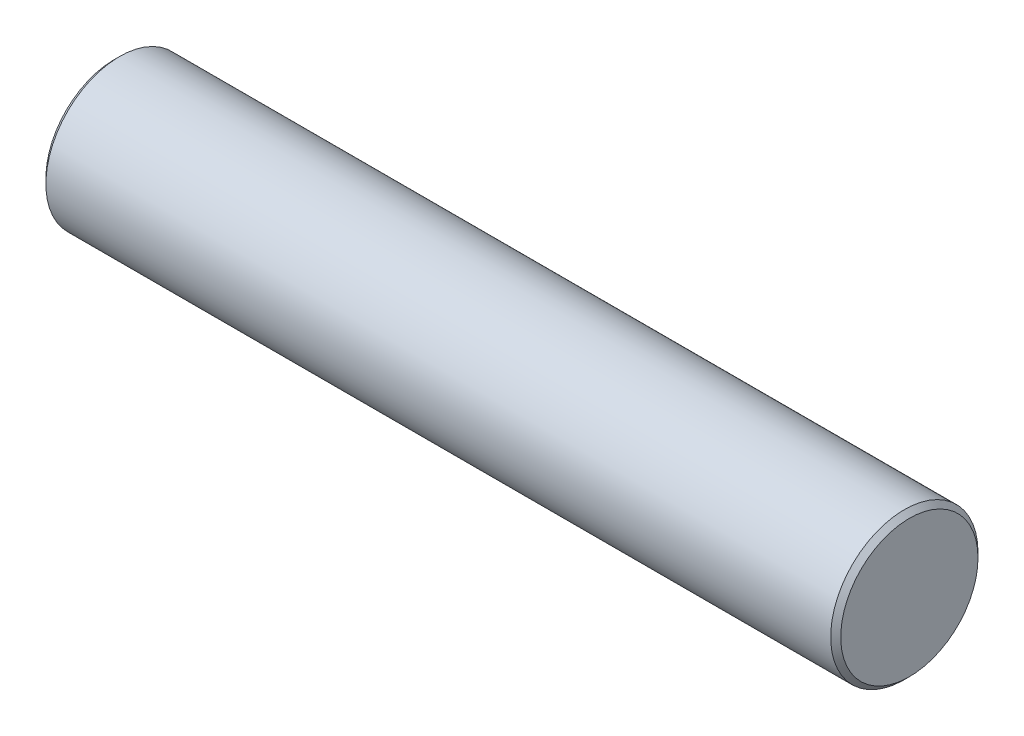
ISO-10303-21;
HEADER;
FILE_DESCRIPTION(('STEP AP214'),'2;1');
FILE_NAME('part.step','',(''),(''),'','','');
FILE_SCHEMA(('AUTOMOTIVE_DESIGN { 1 0 10303 214 1 1 1 1 }'));
ENDSEC;
DATA;
#1=APPLICATION_CONTEXT('core data for automotive mechanical design processes');
#2=APPLICATION_PROTOCOL_DEFINITION('international standard','automotive_design',2000,#1);
#3=PRODUCT_CONTEXT('',#1,'mechanical');
#4=PRODUCT('Part','Part','',(#3));
#5=PRODUCT_RELATED_PRODUCT_CATEGORY('part','',(#4));
#6=PRODUCT_DEFINITION_FORMATION('','',#4);
#7=PRODUCT_DEFINITION_CONTEXT('part definition',#1,'design');
#8=PRODUCT_DEFINITION('design','',#6,#7);
#9=PRODUCT_DEFINITION_SHAPE('','',#8);
#10=(LENGTH_UNIT() NAMED_UNIT(*) SI_UNIT(.MILLI.,.METRE.));
#11=(NAMED_UNIT(*) PLANE_ANGLE_UNIT() SI_UNIT($,.RADIAN.));
#12=(NAMED_UNIT(*) SI_UNIT($,.STERADIAN.) SOLID_ANGLE_UNIT());
#13=UNCERTAINTY_MEASURE_WITH_UNIT(LENGTH_MEASURE(1.E-05),#10,'distance_accuracy_value','');
#14=(GEOMETRIC_REPRESENTATION_CONTEXT(3) GLOBAL_UNCERTAINTY_ASSIGNED_CONTEXT((#13)) GLOBAL_UNIT_ASSIGNED_CONTEXT((#10,
#11,#12)) REPRESENTATION_CONTEXT('',''));
#15=CARTESIAN_POINT('',(0.,0.,0.));
#16=DIRECTION('',(0.,0.,1.));
#17=DIRECTION('',(1.,0.,0.));
#18=AXIS2_PLACEMENT_3D('',#15,#16,#17);
#19=CARTESIAN_POINT('',(72.,91.9464245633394,0.));
#20=DIRECTION('',(1.,0.,0.));
#21=DIRECTION('',(0.,0.,-1.));
#22=AXIS2_PLACEMENT_3D('',#19,#20,#21);
#23=PLANE('',#22);
#24=CARTESIAN_POINT('',(72.,91.9464245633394,0.));
#25=DIRECTION('',(1.,0.,0.));
#26=DIRECTION('',(0.,0.,-1.));
#27=AXIS2_PLACEMENT_3D('',#24,#25,#26);
#28=CIRCLE('',#27,4.19312260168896);
#29=CARTESIAN_POINT('',(72.,91.9464245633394,-4.19312260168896));
#30=VERTEX_POINT('',#29);
#31=EDGE_CURVE('E10',#30,#30,#28,.T.);
#32=ORIENTED_EDGE('',*,*,#31,.T.);
#33=EDGE_LOOP('',(#32));
#34=FACE_BOUND('',#33,.T.);
#35=ADVANCED_FACE('F32',(#34),#23,.T.);
#36=CARTESIAN_POINT('',(72.,91.9464245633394,0.));
#37=DIRECTION('',(-1.,0.,0.));
#38=DIRECTION('',(0.,0.,1.));
#39=AXIS2_PLACEMENT_3D('',#36,#37,#38);
#40=CONICAL_SURFACE('',#39,4.19312260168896,0.785398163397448);
#41=CARTESIAN_POINT('',(71.6931226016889,91.9464245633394,0.));
#42=DIRECTION('',(1.,0.,0.));
#43=DIRECTION('',(0.,0.,-1.));
#44=AXIS2_PLACEMENT_3D('',#41,#42,#43);
#45=CIRCLE('',#44,4.5);
#46=CARTESIAN_POINT('',(71.6931226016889,91.9464245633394,-4.5));
#47=VERTEX_POINT('',#46);
#48=EDGE_CURVE('E38',#47,#47,#45,.T.);
#49=ORIENTED_EDGE('',*,*,#48,.T.);
#50=EDGE_LOOP('',(#49));
#51=FACE_BOUND('',#50,.T.);
#52=ORIENTED_EDGE('',*,*,#31,.F.);
#53=EDGE_LOOP('',(#52));
#54=FACE_BOUND('',#53,.T.);
#55=ADVANCED_FACE('F64',(#51,#54),#40,.T.);
#56=CARTESIAN_POINT('',(72.0327351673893,91.9464245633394,0.));
#57=DIRECTION('',(1.,0.,0.));
#58=DIRECTION('',(0.,0.,-1.));
#59=AXIS2_PLACEMENT_3D('',#56,#57,#58);
#60=CYLINDRICAL_SURFACE('',#59,4.5);
#61=CARTESIAN_POINT('',(23.7473670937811,91.9464245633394,0.));
#62=DIRECTION('',(1.,0.,0.));
#63=DIRECTION('',(0.,0.,-1.));
#64=AXIS2_PLACEMENT_3D('',#61,#62,#63);
#65=CIRCLE('',#64,4.5);
#66=CARTESIAN_POINT('',(23.7473670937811,91.9464245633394,-4.5));
#67=VERTEX_POINT('',#66);
#68=EDGE_CURVE('E42',#67,#67,#65,.T.);
#69=ORIENTED_EDGE('',*,*,#68,.T.);
#70=EDGE_LOOP('',(#69));
#71=FACE_BOUND('',#70,.T.);
#72=ORIENTED_EDGE('',*,*,#48,.F.);
#73=EDGE_LOOP('',(#72));
#74=FACE_BOUND('',#73,.T.);
#75=ADVANCED_FACE('F61',(#71,#74),#60,.T.);
#76=CARTESIAN_POINT('',(23.7473670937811,91.9464245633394,0.));
#77=DIRECTION('',(1.,0.,0.));
#78=DIRECTION('',(0.,0.,-1.));
#79=AXIS2_PLACEMENT_3D('',#76,#77,#78);
#80=CONICAL_SURFACE('',#79,4.5,0.785398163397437);
#81=CARTESIAN_POINT('',(23.4404896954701,91.9464245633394,0.));
#82=DIRECTION('',(1.,0.,0.));
#83=DIRECTION('',(0.,0.,-1.));
#84=AXIS2_PLACEMENT_3D('',#81,#82,#83);
#85=CIRCLE('',#84,4.19312260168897);
#86=CARTESIAN_POINT('',(23.4404896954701,91.9464245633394,-4.19312260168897));
#87=VERTEX_POINT('',#86);
#88=EDGE_CURVE('E46',#87,#87,#85,.T.);
#89=ORIENTED_EDGE('',*,*,#88,.T.);
#90=EDGE_LOOP('',(#89));
#91=FACE_BOUND('',#90,.T.);
#92=ORIENTED_EDGE('',*,*,#68,.F.);
#93=EDGE_LOOP('',(#92));
#94=FACE_BOUND('',#93,.T.);
#95=ADVANCED_FACE('F52',(#91,#94),#80,.T.);
#96=CARTESIAN_POINT('',(23.4404896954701,91.9464245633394,0.));
#97=DIRECTION('',(-1.,0.,0.));
#98=DIRECTION('',(0.,0.,1.));
#99=AXIS2_PLACEMENT_3D('',#96,#97,#98);
#100=PLANE('',#99);
#101=ORIENTED_EDGE('',*,*,#88,.F.);
#102=EDGE_LOOP('',(#101));
#103=FACE_BOUND('',#102,.T.);
#104=ADVANCED_FACE('F55',(#103),#100,.T.);
#105=CLOSED_SHELL('',(#35,#55,#75,#95,#104));
#106=MANIFOLD_SOLID_BREP('B2',#105);
#107=ADVANCED_BREP_SHAPE_REPRESENTATION('',(#18,#106),#14);
#108=SHAPE_DEFINITION_REPRESENTATION(#9,#107);
ENDSEC;
END-ISO-10303-21;
